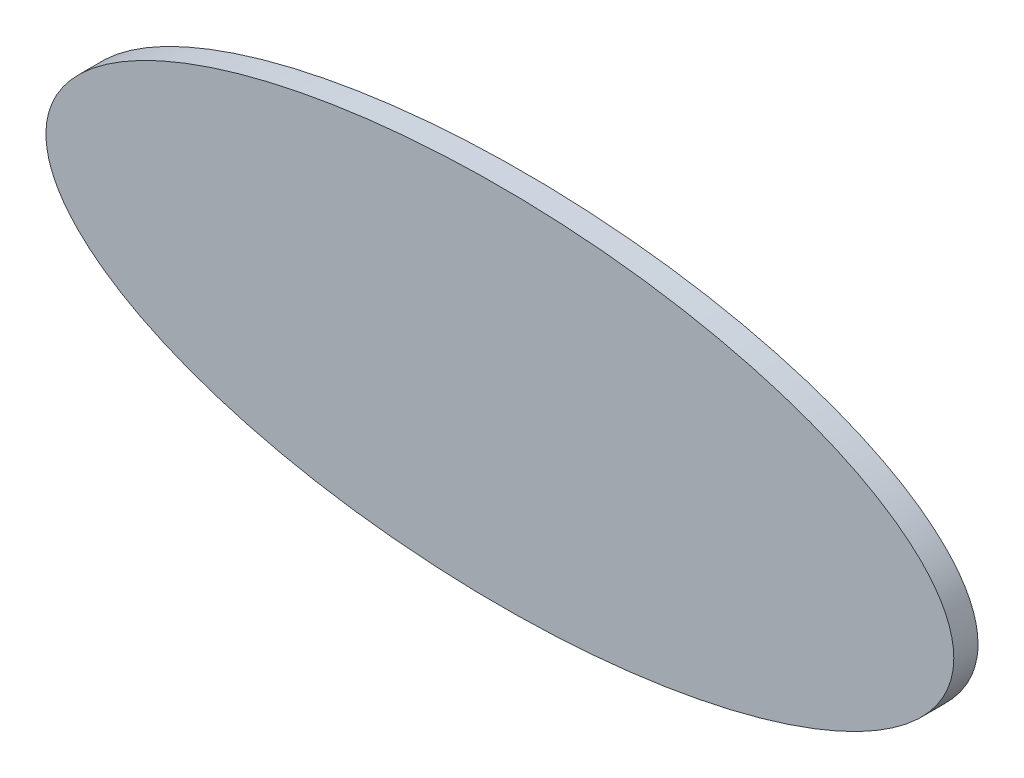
ISO-10303-21;
HEADER;
FILE_DESCRIPTION(('STEP AP214'),'2;1');
FILE_NAME('part.step','',(''),(''),'','','');
FILE_SCHEMA(('AUTOMOTIVE_DESIGN { 1 0 10303 214 1 1 1 1 }'));
ENDSEC;
DATA;
#1=APPLICATION_CONTEXT('core data for automotive mechanical design processes');
#2=APPLICATION_PROTOCOL_DEFINITION('international standard','automotive_design',2000,#1);
#3=PRODUCT_CONTEXT('',#1,'mechanical');
#4=PRODUCT('Part','Part','',(#3));
#5=PRODUCT_RELATED_PRODUCT_CATEGORY('part','',(#4));
#6=PRODUCT_DEFINITION_FORMATION('','',#4);
#7=PRODUCT_DEFINITION_CONTEXT('part definition',#1,'design');
#8=PRODUCT_DEFINITION('design','',#6,#7);
#9=PRODUCT_DEFINITION_SHAPE('','',#8);
#10=(LENGTH_UNIT() NAMED_UNIT(*) SI_UNIT(.MILLI.,.METRE.));
#11=(NAMED_UNIT(*) PLANE_ANGLE_UNIT() SI_UNIT($,.RADIAN.));
#12=(NAMED_UNIT(*) SI_UNIT($,.STERADIAN.) SOLID_ANGLE_UNIT());
#13=UNCERTAINTY_MEASURE_WITH_UNIT(LENGTH_MEASURE(1.E-05),#10,'distance_accuracy_value','');
#14=(GEOMETRIC_REPRESENTATION_CONTEXT(3) GLOBAL_UNCERTAINTY_ASSIGNED_CONTEXT((#13)) GLOBAL_UNIT_ASSIGNED_CONTEXT((#10,
#11,#12)) REPRESENTATION_CONTEXT('',''));
#15=CARTESIAN_POINT('',(0.,0.,0.));
#16=DIRECTION('',(0.,0.,1.));
#17=DIRECTION('',(1.,0.,0.));
#18=AXIS2_PLACEMENT_3D('',#15,#16,#17);
#19=CARTESIAN_POINT('',(0.,0.,2.));
#20=DIRECTION('',(0.,0.,1.));
#21=DIRECTION('',(1.,0.,0.));
#22=AXIS2_PLACEMENT_3D('',#19,#20,#21);
#23=ELLIPSE('',#22,37.5,15.);
#24=DIRECTION('',(0.,0.,-1.));
#25=VECTOR('',#24,1.);
#26=SURFACE_OF_LINEAR_EXTRUSION('',#23,#25);
#27=CARTESIAN_POINT('',(37.5,0.,2.));
#28=VERTEX_POINT('',#27);
#29=EDGE_CURVE('E10',#28,#28,#23,.T.);
#30=ORIENTED_EDGE('',*,*,#29,.F.);
#31=EDGE_LOOP('',(#30));
#32=FACE_BOUND('',#31,.T.);
#33=CARTESIAN_POINT('',(0.,0.,0.));
#34=DIRECTION('',(0.,0.,1.));
#35=DIRECTION('',(1.,0.,0.));
#36=AXIS2_PLACEMENT_3D('',#33,#34,#35);
#37=ELLIPSE('',#36,37.5,15.);
#38=CARTESIAN_POINT('',(37.5,0.,0.));
#39=VERTEX_POINT('',#38);
#40=EDGE_CURVE('E34',#39,#39,#37,.T.);
#41=ORIENTED_EDGE('',*,*,#40,.T.);
#42=EDGE_LOOP('',(#41));
#43=FACE_BOUND('',#42,.T.);
#44=ADVANCED_FACE('F27',(#32,#43),#26,.F.);
#45=CARTESIAN_POINT('',(0.,0.,2.));
#46=DIRECTION('',(0.,0.,1.));
#47=DIRECTION('',(1.,0.,0.));
#48=AXIS2_PLACEMENT_3D('',#45,#46,#47);
#49=PLANE('',#48);
#50=ORIENTED_EDGE('',*,*,#29,.T.);
#51=EDGE_LOOP('',(#50));
#52=FACE_BOUND('',#51,.T.);
#53=ADVANCED_FACE('F43',(#52),#49,.T.);
#54=CARTESIAN_POINT('',(0.,0.,0.));
#55=DIRECTION('',(0.,0.,1.));
#56=DIRECTION('',(1.,0.,0.));
#57=AXIS2_PLACEMENT_3D('',#54,#55,#56);
#58=PLANE('',#57);
#59=ORIENTED_EDGE('',*,*,#40,.F.);
#60=EDGE_LOOP('',(#59));
#61=FACE_BOUND('',#60,.T.);
#62=ADVANCED_FACE('F41',(#61),#58,.F.);
#63=CLOSED_SHELL('',(#44,#53,#62));
#64=MANIFOLD_SOLID_BREP('B2',#63);
#65=ADVANCED_BREP_SHAPE_REPRESENTATION('',(#18,#64),#14);
#66=SHAPE_DEFINITION_REPRESENTATION(#9,#65);
ENDSEC;
END-ISO-10303-21;
